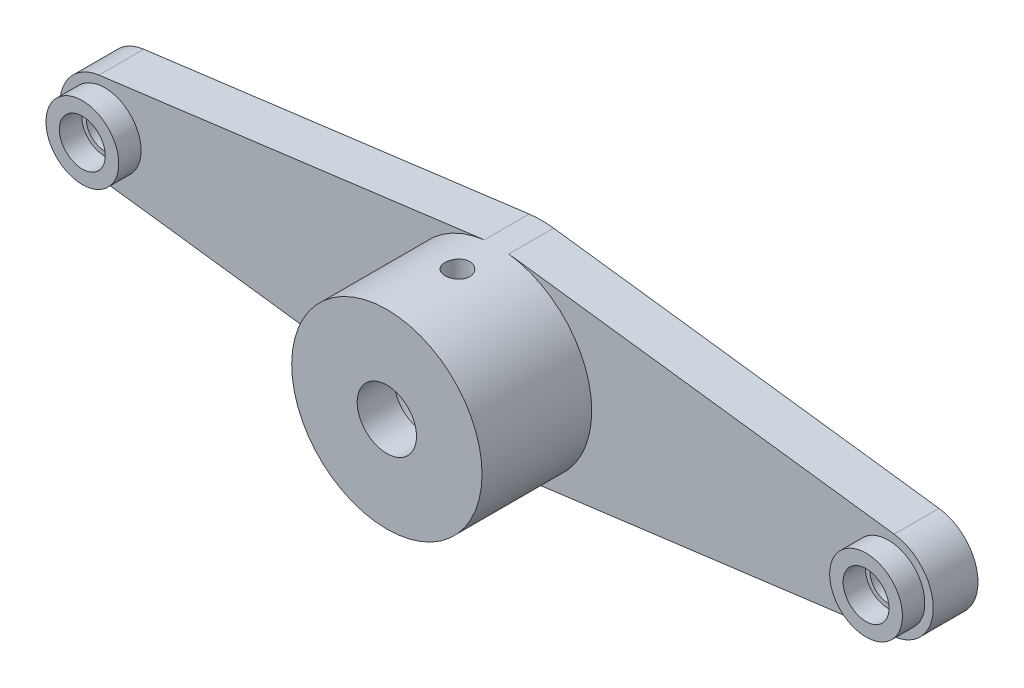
ISO-10303-21;
HEADER;
FILE_DESCRIPTION(('STEP AP214'),'2;1');
FILE_NAME('part.step','',(''),(''),'','','');
FILE_SCHEMA(('AUTOMOTIVE_DESIGN { 1 0 10303 214 1 1 1 1 }'));
ENDSEC;
DATA;
#1=APPLICATION_CONTEXT('core data for automotive mechanical design processes');
#2=APPLICATION_PROTOCOL_DEFINITION('international standard','automotive_design',2000,#1);
#3=PRODUCT_CONTEXT('',#1,'mechanical');
#4=PRODUCT('Part','Part','',(#3));
#5=PRODUCT_RELATED_PRODUCT_CATEGORY('part','',(#4));
#6=PRODUCT_DEFINITION_FORMATION('','',#4);
#7=PRODUCT_DEFINITION_CONTEXT('part definition',#1,'design');
#8=PRODUCT_DEFINITION('design','',#6,#7);
#9=PRODUCT_DEFINITION_SHAPE('','',#8);
#10=(LENGTH_UNIT() NAMED_UNIT(*) SI_UNIT(.MILLI.,.METRE.));
#11=(NAMED_UNIT(*) PLANE_ANGLE_UNIT() SI_UNIT($,.RADIAN.));
#12=(NAMED_UNIT(*) SI_UNIT($,.STERADIAN.) SOLID_ANGLE_UNIT());
#13=UNCERTAINTY_MEASURE_WITH_UNIT(LENGTH_MEASURE(1.E-05),#10,'distance_accuracy_value','');
#14=(GEOMETRIC_REPRESENTATION_CONTEXT(3) GLOBAL_UNCERTAINTY_ASSIGNED_CONTEXT((#13)) GLOBAL_UNIT_ASSIGNED_CONTEXT((#10,
#11,#12)) REPRESENTATION_CONTEXT('',''));
#15=CARTESIAN_POINT('',(0.,0.,0.));
#16=DIRECTION('',(0.,0.,1.));
#17=DIRECTION('',(1.,0.,0.));
#18=AXIS2_PLACEMENT_3D('',#15,#16,#17);
#19=CARTESIAN_POINT('',(-35.,0.,4.));
#20=DIRECTION('',(0.,0.,1.));
#21=DIRECTION('',(1.,0.,0.));
#22=AXIS2_PLACEMENT_3D('',#19,#20,#21);
#23=PLANE('',#22);
#24=CARTESIAN_POINT('',(35.,0.,4.));
#25=DIRECTION('',(0.,0.,1.));
#26=DIRECTION('',(1.,0.,0.));
#27=AXIS2_PLACEMENT_3D('',#24,#25,#26);
#28=CIRCLE('',#27,1.64999999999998);
#29=CARTESIAN_POINT('',(36.65,0.,4.));
#30=VERTEX_POINT('',#29);
#31=EDGE_CURVE('E249',#30,#30,#28,.T.);
#32=ORIENTED_EDGE('',*,*,#31,.F.);
#33=EDGE_LOOP('',(#32));
#34=FACE_BOUND('',#33,.T.);
#35=CARTESIAN_POINT('',(35.,0.,4.));
#36=DIRECTION('',(0.,0.,1.));
#37=DIRECTION('',(1.,0.,0.));
#38=AXIS2_PLACEMENT_3D('',#35,#36,#37);
#39=CIRCLE('',#38,2.04999999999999);
#40=CARTESIAN_POINT('',(37.05,0.,4.));
#41=VERTEX_POINT('',#40);
#42=EDGE_CURVE('E11',#41,#41,#39,.F.);
#43=ORIENTED_EDGE('',*,*,#42,.F.);
#44=EDGE_LOOP('',(#43));
#45=FACE_BOUND('',#44,.T.);
#46=ADVANCED_FACE('F36',(#34,#45),#23,.T.);
#47=CARTESIAN_POINT('',(-35.,0.,4.));
#48=DIRECTION('',(0.,0.,1.));
#49=DIRECTION('',(1.,0.,0.));
#50=AXIS2_PLACEMENT_3D('',#47,#48,#49);
#51=CIRCLE('',#50,1.64999999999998);
#52=CARTESIAN_POINT('',(-33.35,0.,4.));
#53=VERTEX_POINT('',#52);
#54=EDGE_CURVE('E322',#53,#53,#51,.T.);
#55=ORIENTED_EDGE('',*,*,#54,.F.);
#56=EDGE_LOOP('',(#55));
#57=FACE_BOUND('',#56,.T.);
#58=CARTESIAN_POINT('',(-35.,0.,4.));
#59=DIRECTION('',(0.,0.,1.));
#60=DIRECTION('',(1.,0.,0.));
#61=AXIS2_PLACEMENT_3D('',#58,#59,#60);
#62=CIRCLE('',#61,2.04999999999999);
#63=CARTESIAN_POINT('',(-32.95,0.,4.));
#64=VERTEX_POINT('',#63);
#65=EDGE_CURVE('E45',#64,#64,#62,.F.);
#66=ORIENTED_EDGE('',*,*,#65,.F.);
#67=EDGE_LOOP('',(#66));
#68=FACE_BOUND('',#67,.T.);
#69=ADVANCED_FACE('F220',(#57,#68),#23,.T.);
#70=CARTESIAN_POINT('',(0.,0.,4.));
#71=DIRECTION('',(0.,0.,-1.));
#72=DIRECTION('',(-1.,0.,0.));
#73=AXIS2_PLACEMENT_3D('',#70,#71,#72);
#74=CYLINDRICAL_SURFACE('',#73,5.25);
#75=CARTESIAN_POINT('',(0.,-5.25,8.6));
#76=CARTESIAN_POINT('',(0.061071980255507,-5.24999886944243,8.5999978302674));
#77=CARTESIAN_POINT('',(0.122170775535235,-5.24892346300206,8.59489674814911));
#78=CARTESIAN_POINT('',(0.242637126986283,-5.2447372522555,8.57464587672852));
#79=CARTESIAN_POINT('',(0.30200334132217,-5.24162491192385,8.55948850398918));
#80=CARTESIAN_POINT('',(0.417245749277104,-5.23371187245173,8.51961725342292));
#81=CARTESIAN_POINT('',(0.473125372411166,-5.22891286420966,8.49491294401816));
#82=CARTESIAN_POINT('',(0.579943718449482,-5.21814631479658,8.43667849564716));
#83=CARTESIAN_POINT('',(0.630882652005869,-5.212178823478,8.4031487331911));
#84=CARTESIAN_POINT('',(0.727130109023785,-5.19963186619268,8.32768978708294));
#85=CARTESIAN_POINT('',(0.772355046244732,-5.19304533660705,8.28565515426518));
#86=CARTESIAN_POINT('',(0.855166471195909,-5.18005322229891,8.19460621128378));
#87=CARTESIAN_POINT('',(0.892752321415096,-5.17364765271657,8.14559131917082));
#88=CARTESIAN_POINT('',(0.959580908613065,-5.16167342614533,8.0413635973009));
#89=CARTESIAN_POINT('',(0.988735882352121,-5.15611383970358,7.98609336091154));
#90=CARTESIAN_POINT('',(1.03731251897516,-5.1465619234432,7.8713026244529));
#91=CARTESIAN_POINT('',(1.0567352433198,-5.14256942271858,7.81178258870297));
#92=CARTESIAN_POINT('',(1.0850222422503,-5.13667543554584,7.69108486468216));
#93=CARTESIAN_POINT('',(1.0940338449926,-5.13474480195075,7.62994315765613));
#94=CARTESIAN_POINT('',(1.10170065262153,-5.13310551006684,7.50698754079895));
#95=CARTESIAN_POINT('',(1.10035702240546,-5.13339660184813,7.44517370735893));
#96=CARTESIAN_POINT('',(1.08747034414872,-5.136141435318,7.32371499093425));
#97=CARTESIAN_POINT('',(1.07609730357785,-5.13855912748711,7.26405113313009));
#98=CARTESIAN_POINT('',(1.04374348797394,-5.14522787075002,7.14749749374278));
#99=CARTESIAN_POINT('',(1.02276221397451,-5.14947901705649,7.09060785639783));
#100=CARTESIAN_POINT('',(0.971628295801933,-5.15937186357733,6.98073359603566));
#101=CARTESIAN_POINT('',(0.941409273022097,-5.16502357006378,6.92778080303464));
#102=CARTESIAN_POINT('',(0.872704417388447,-5.1770744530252,6.82763431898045));
#103=CARTESIAN_POINT('',(0.834217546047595,-5.18347372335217,6.78044135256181));
#104=CARTESIAN_POINT('',(0.749164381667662,-5.19645412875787,6.69217425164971));
#105=CARTESIAN_POINT('',(0.702453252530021,-5.20303635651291,6.65123971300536));
#106=CARTESIAN_POINT('',(0.602756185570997,-5.2155253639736,6.57776386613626));
#107=CARTESIAN_POINT('',(0.549770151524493,-5.22143213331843,6.54522268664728));
#108=CARTESIAN_POINT('',(0.438864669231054,-5.23192145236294,6.4894271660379));
#109=CARTESIAN_POINT('',(0.380936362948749,-5.23650155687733,6.46618994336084));
#110=CARTESIAN_POINT('',(0.261880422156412,-5.24380314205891,6.4298170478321));
#111=CARTESIAN_POINT('',(0.200753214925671,-5.24652487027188,6.4166800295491));
#112=CARTESIAN_POINT('',(0.0782331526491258,-5.24976818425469,6.40108077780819));
#113=CARTESIAN_POINT('',(0.0168656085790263,-5.25032910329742,6.39842768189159));
#114=CARTESIAN_POINT('',(-0.105435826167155,-5.24929733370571,6.40335592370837));
#115=CARTESIAN_POINT('',(-0.166369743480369,-5.24770477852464,6.4109366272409));
#116=CARTESIAN_POINT('',(-0.285450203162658,-5.2425697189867,6.43595884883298));
#117=CARTESIAN_POINT('',(-0.343618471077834,-5.23904680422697,6.45330135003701));
#118=CARTESIAN_POINT('',(-0.456220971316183,-5.23044491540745,6.4972458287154));
#119=CARTESIAN_POINT('',(-0.510654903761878,-5.22536581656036,6.5238485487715));
#120=CARTESIAN_POINT('',(-0.615040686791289,-5.21411740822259,6.58596360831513));
#121=CARTESIAN_POINT('',(-0.664923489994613,-5.20793452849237,6.62158947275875));
#122=CARTESIAN_POINT('',(-0.758071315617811,-5.19519412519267,6.70058878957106));
#123=CARTESIAN_POINT('',(-0.801335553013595,-5.18863655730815,6.74396315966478));
#124=CARTESIAN_POINT('',(-0.880763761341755,-5.17575162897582,6.83810068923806));
#125=CARTESIAN_POINT('',(-0.916796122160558,-5.16942999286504,6.88897581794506));
#126=CARTESIAN_POINT('',(-0.979805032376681,-5.1578592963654,6.99616811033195));
#127=CARTESIAN_POINT('',(-1.00678196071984,-5.15261019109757,7.05248504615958));
#128=CARTESIAN_POINT('',(-1.05074022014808,-5.14382620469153,7.16866798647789));
#129=CARTESIAN_POINT('',(-1.06777578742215,-5.14028204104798,7.22851273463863));
#130=CARTESIAN_POINT('',(-1.0915296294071,-5.13529094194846,7.35029833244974));
#131=CARTESIAN_POINT('',(-1.09824939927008,-5.13384370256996,7.41223887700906));
#132=CARTESIAN_POINT('',(-1.10112138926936,-5.13322833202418,7.53513371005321));
#133=CARTESIAN_POINT('',(-1.0974819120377,-5.13401527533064,7.59608299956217));
#134=CARTESIAN_POINT('',(-1.08020141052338,-5.13767861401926,7.71647954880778));
#135=CARTESIAN_POINT('',(-1.06656048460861,-5.1405549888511,7.77592682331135));
#136=CARTESIAN_POINT('',(-1.02976112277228,-5.14805209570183,7.89148290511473));
#137=CARTESIAN_POINT('',(-1.00663061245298,-5.15266770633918,7.94760095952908));
#138=CARTESIAN_POINT('',(-0.951533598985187,-5.16312566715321,8.05519160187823));
#139=CARTESIAN_POINT('',(-0.919566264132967,-5.1689681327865,8.10666375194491));
#140=CARTESIAN_POINT('',(-0.847001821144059,-5.18135734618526,8.20453358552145));
#141=CARTESIAN_POINT('',(-0.806255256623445,-5.18791517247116,8.25081907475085));
#142=CARTESIAN_POINT('',(-0.71759479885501,-5.20091926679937,8.3359641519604));
#143=CARTESIAN_POINT('',(-0.669679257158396,-5.20736550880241,8.37482202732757));
#144=CARTESIAN_POINT('',(-0.567366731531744,-5.21950926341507,8.44444094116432));
#145=CARTESIAN_POINT('',(-0.512900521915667,-5.22519714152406,8.47510200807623));
#146=CARTESIAN_POINT('',(-0.399482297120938,-5.23508763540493,8.52678650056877));
#147=CARTESIAN_POINT('',(-0.340534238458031,-5.23929154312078,8.54781831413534));
#148=CARTESIAN_POINT('',(-0.234574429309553,-5.24495671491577,8.57573493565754));
#149=CARTESIAN_POINT('',(-0.188151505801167,-5.24683655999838,8.58481755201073));
#150=CARTESIAN_POINT('',(-0.0944910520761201,-5.24935861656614,8.59695080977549));
#151=CARTESIAN_POINT('',(-0.0472535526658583,-5.2500008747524,8.60000167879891));
#152=CARTESIAN_POINT('',(0.,-5.25,8.6));
#153=B_SPLINE_CURVE_WITH_KNOTS('',3,(#75,#76,#77,#78,#79,#80,#81,#82,#83,#84,#85,#86,#87,#88,
#89,#90,#91,#92,#93,#94,#95,#96,#97,#98,#99,#100,#101,#102,#103,#104,#105,#106,#107,#108,#109,
#110,#111,#112,#113,#114,#115,#116,#117,#118,#119,#120,#121,#122,#123,#124,#125,#126,#127,#128,
#129,#130,#131,#132,#133,#134,#135,#136,#137,#138,#139,#140,#141,#142,#143,#144,#145,#146,#147,
#148,#149,#150,#151,#152),.UNSPECIFIED.,.T.,.F.,(4,2,2,2,2,2,2,2,2,2,2,2,2,2,2,2,2,2,2,2,2,2,2,
2,2,2,2,2,2,2,2,2,2,2,2,2,2,2,4),(0.,0.183043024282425,0.366224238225,0.549222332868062,
0.732212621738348,0.917628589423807,1.10306002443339,1.29035746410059,1.47763447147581,
1.6622275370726,1.84679983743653,2.02830234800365,2.20981428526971,2.39266243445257,
2.57553356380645,2.76202420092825,2.94851769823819,3.13535276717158,3.32216294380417,
3.50555608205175,3.68893785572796,3.87049221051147,4.05206112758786,4.23603899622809,
4.42003866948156,4.60713200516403,4.79421751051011,4.98027257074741,5.16630066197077,
5.34861470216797,5.5309269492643,5.71270649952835,5.89450316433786,6.07968129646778,
6.26490207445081,6.45228827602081,6.63951093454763,6.78114314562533,6.92277001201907),.UNSPECIFIED.);
#154=CARTESIAN_POINT('',(0.,-5.25,8.6));
#155=VERTEX_POINT('',#154);
#156=EDGE_CURVE('E208',#155,#155,#153,.T.);
#157=ORIENTED_EDGE('',*,*,#156,.F.);
#158=EDGE_LOOP('',(#157));
#159=FACE_BOUND('',#158,.T.);
#160=CARTESIAN_POINT('',(0.,5.25,8.6));
#161=CARTESIAN_POINT('',(-0.061071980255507,5.24999886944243,8.5999978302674));
#162=CARTESIAN_POINT('',(-0.122170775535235,5.24892346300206,8.59489674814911));
#163=CARTESIAN_POINT('',(-0.242637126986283,5.2447372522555,8.57464587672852));
#164=CARTESIAN_POINT('',(-0.30200334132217,5.24162491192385,8.55948850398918));
#165=CARTESIAN_POINT('',(-0.417245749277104,5.23371187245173,8.51961725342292));
#166=CARTESIAN_POINT('',(-0.473125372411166,5.22891286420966,8.49491294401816));
#167=CARTESIAN_POINT('',(-0.579943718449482,5.21814631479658,8.43667849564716));
#168=CARTESIAN_POINT('',(-0.630882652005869,5.212178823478,8.4031487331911));
#169=CARTESIAN_POINT('',(-0.727130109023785,5.19963186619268,8.32768978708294));
#170=CARTESIAN_POINT('',(-0.772355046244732,5.19304533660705,8.28565515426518));
#171=CARTESIAN_POINT('',(-0.855166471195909,5.18005322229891,8.19460621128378));
#172=CARTESIAN_POINT('',(-0.892752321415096,5.17364765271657,8.14559131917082));
#173=CARTESIAN_POINT('',(-0.959580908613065,5.16167342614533,8.0413635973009));
#174=CARTESIAN_POINT('',(-0.988735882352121,5.15611383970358,7.98609336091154));
#175=CARTESIAN_POINT('',(-1.03731251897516,5.1465619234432,7.8713026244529));
#176=CARTESIAN_POINT('',(-1.0567352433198,5.14256942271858,7.81178258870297));
#177=CARTESIAN_POINT('',(-1.0850222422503,5.13667543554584,7.69108486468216));
#178=CARTESIAN_POINT('',(-1.0940338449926,5.13474480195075,7.62994315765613));
#179=CARTESIAN_POINT('',(-1.10170065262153,5.13310551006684,7.50698754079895));
#180=CARTESIAN_POINT('',(-1.10035702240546,5.13339660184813,7.44517370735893));
#181=CARTESIAN_POINT('',(-1.08747034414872,5.136141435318,7.32371499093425));
#182=CARTESIAN_POINT('',(-1.07609730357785,5.13855912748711,7.26405113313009));
#183=CARTESIAN_POINT('',(-1.04374348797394,5.14522787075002,7.14749749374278));
#184=CARTESIAN_POINT('',(-1.02276221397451,5.14947901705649,7.09060785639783));
#185=CARTESIAN_POINT('',(-0.971628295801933,5.15937186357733,6.98073359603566));
#186=CARTESIAN_POINT('',(-0.941409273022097,5.16502357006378,6.92778080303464));
#187=CARTESIAN_POINT('',(-0.872704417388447,5.1770744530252,6.82763431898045));
#188=CARTESIAN_POINT('',(-0.834217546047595,5.18347372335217,6.78044135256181));
#189=CARTESIAN_POINT('',(-0.749164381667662,5.19645412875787,6.69217425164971));
#190=CARTESIAN_POINT('',(-0.702453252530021,5.20303635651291,6.65123971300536));
#191=CARTESIAN_POINT('',(-0.602756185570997,5.2155253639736,6.57776386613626));
#192=CARTESIAN_POINT('',(-0.549770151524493,5.22143213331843,6.54522268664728));
#193=CARTESIAN_POINT('',(-0.438864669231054,5.23192145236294,6.4894271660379));
#194=CARTESIAN_POINT('',(-0.380936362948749,5.23650155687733,6.46618994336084));
#195=CARTESIAN_POINT('',(-0.261880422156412,5.24380314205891,6.4298170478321));
#196=CARTESIAN_POINT('',(-0.200753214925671,5.24652487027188,6.4166800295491));
#197=CARTESIAN_POINT('',(-0.0782331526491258,5.24976818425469,6.40108077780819));
#198=CARTESIAN_POINT('',(-0.0168656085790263,5.25032910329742,6.39842768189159));
#199=CARTESIAN_POINT('',(0.105435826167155,5.24929733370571,6.40335592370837));
#200=CARTESIAN_POINT('',(0.166369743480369,5.24770477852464,6.4109366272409));
#201=CARTESIAN_POINT('',(0.285450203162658,5.2425697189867,6.43595884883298));
#202=CARTESIAN_POINT('',(0.343618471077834,5.23904680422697,6.45330135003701));
#203=CARTESIAN_POINT('',(0.456220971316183,5.23044491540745,6.4972458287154));
#204=CARTESIAN_POINT('',(0.510654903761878,5.22536581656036,6.5238485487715));
#205=CARTESIAN_POINT('',(0.615040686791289,5.21411740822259,6.58596360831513));
#206=CARTESIAN_POINT('',(0.664923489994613,5.20793452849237,6.62158947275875));
#207=CARTESIAN_POINT('',(0.758071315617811,5.19519412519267,6.70058878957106));
#208=CARTESIAN_POINT('',(0.801335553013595,5.18863655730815,6.74396315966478));
#209=CARTESIAN_POINT('',(0.880763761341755,5.17575162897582,6.83810068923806));
#210=CARTESIAN_POINT('',(0.916796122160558,5.16942999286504,6.88897581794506));
#211=CARTESIAN_POINT('',(0.979805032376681,5.1578592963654,6.99616811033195));
#212=CARTESIAN_POINT('',(1.00678196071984,5.15261019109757,7.05248504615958));
#213=CARTESIAN_POINT('',(1.05074022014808,5.14382620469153,7.16866798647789));
#214=CARTESIAN_POINT('',(1.06777578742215,5.14028204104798,7.22851273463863));
#215=CARTESIAN_POINT('',(1.0915296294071,5.13529094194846,7.35029833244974));
#216=CARTESIAN_POINT('',(1.09824939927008,5.13384370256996,7.41223887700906));
#217=CARTESIAN_POINT('',(1.10112138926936,5.13322833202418,7.53513371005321));
#218=CARTESIAN_POINT('',(1.0974819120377,5.13401527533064,7.59608299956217));
#219=CARTESIAN_POINT('',(1.08020141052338,5.13767861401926,7.71647954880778));
#220=CARTESIAN_POINT('',(1.06656048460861,5.1405549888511,7.77592682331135));
#221=CARTESIAN_POINT('',(1.02976112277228,5.14805209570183,7.89148290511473));
#222=CARTESIAN_POINT('',(1.00663061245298,5.15266770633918,7.94760095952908));
#223=CARTESIAN_POINT('',(0.951533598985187,5.16312566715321,8.05519160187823));
#224=CARTESIAN_POINT('',(0.919566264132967,5.1689681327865,8.10666375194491));
#225=CARTESIAN_POINT('',(0.847001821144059,5.18135734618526,8.20453358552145));
#226=CARTESIAN_POINT('',(0.806255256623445,5.18791517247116,8.25081907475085));
#227=CARTESIAN_POINT('',(0.71759479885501,5.20091926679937,8.3359641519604));
#228=CARTESIAN_POINT('',(0.669679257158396,5.20736550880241,8.37482202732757));
#229=CARTESIAN_POINT('',(0.567366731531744,5.21950926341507,8.44444094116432));
#230=CARTESIAN_POINT('',(0.512900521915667,5.22519714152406,8.47510200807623));
#231=CARTESIAN_POINT('',(0.399482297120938,5.23508763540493,8.52678650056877));
#232=CARTESIAN_POINT('',(0.340534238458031,5.23929154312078,8.54781831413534));
#233=CARTESIAN_POINT('',(0.234574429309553,5.24495671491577,8.57573493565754));
#234=CARTESIAN_POINT('',(0.188151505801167,5.24683655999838,8.58481755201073));
#235=CARTESIAN_POINT('',(0.0944910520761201,5.24935861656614,8.59695080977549));
#236=CARTESIAN_POINT('',(0.0472535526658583,5.2500008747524,8.60000167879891));
#237=CARTESIAN_POINT('',(0.,5.25,8.6));
#238=B_SPLINE_CURVE_WITH_KNOTS('',3,(#160,#161,#162,#163,#164,#165,#166,#167,#168,#169,#170,
#171,#172,#173,#174,#175,#176,#177,#178,#179,#180,#181,#182,#183,#184,#185,#186,#187,#188,#189,
#190,#191,#192,#193,#194,#195,#196,#197,#198,#199,#200,#201,#202,#203,#204,#205,#206,#207,#208,
#209,#210,#211,#212,#213,#214,#215,#216,#217,#218,#219,#220,#221,#222,#223,#224,#225,#226,#227,
#228,#229,#230,#231,#232,#233,#234,#235,#236,#237),.UNSPECIFIED.,.T.,.F.,(4,2,2,2,2,2,2,2,2,2,2,
2,2,2,2,2,2,2,2,2,2,2,2,2,2,2,2,2,2,2,2,2,2,2,2,2,2,2,4),(0.,0.183043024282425,0.366224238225,
0.549222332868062,0.732212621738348,0.917628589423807,1.10306002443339,1.29035746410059,
1.47763447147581,1.6622275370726,1.84679983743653,2.02830234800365,2.20981428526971,
2.39266243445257,2.57553356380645,2.76202420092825,2.94851769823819,3.13535276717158,
3.32216294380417,3.50555608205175,3.68893785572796,3.87049221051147,4.05206112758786,
4.23603899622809,4.42003866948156,4.60713200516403,4.79421751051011,4.98027257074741,
5.16630066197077,5.34861470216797,5.5309269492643,5.71270649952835,5.89450316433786,
6.07968129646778,6.26490207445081,6.45228827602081,6.63951093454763,6.78114314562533,
6.92277001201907),.UNSPECIFIED.);
#239=CARTESIAN_POINT('',(0.,5.25,8.6));
#240=VERTEX_POINT('',#239);
#241=EDGE_CURVE('E202',#240,#240,#238,.T.);
#242=ORIENTED_EDGE('',*,*,#241,.F.);
#243=EDGE_LOOP('',(#242));
#244=FACE_BOUND('',#243,.T.);
#245=CARTESIAN_POINT('',(0.,0.,0.));
#246=DIRECTION('',(0.,0.,1.));
#247=DIRECTION('',(1.,0.,0.));
#248=AXIS2_PLACEMENT_3D('',#245,#246,#247);
#249=CIRCLE('',#248,5.25);
#250=CARTESIAN_POINT('',(5.25,0.,0.));
#251=VERTEX_POINT('',#250);
#252=EDGE_CURVE('E144',#251,#251,#249,.T.);
#253=ORIENTED_EDGE('',*,*,#252,.F.);
#254=EDGE_LOOP('',(#253));
#255=FACE_BOUND('',#254,.T.);
#256=CARTESIAN_POINT('',(0.,0.,10.5));
#257=DIRECTION('',(0.,0.,1.));
#258=DIRECTION('',(1.,0.,0.));
#259=AXIS2_PLACEMENT_3D('',#256,#257,#258);
#260=CIRCLE('',#259,5.25);
#261=CARTESIAN_POINT('',(5.25,0.,10.5));
#262=VERTEX_POINT('',#261);
#263=EDGE_CURVE('E328',#262,#262,#260,.T.);
#264=ORIENTED_EDGE('',*,*,#263,.T.);
#265=EDGE_LOOP('',(#264));
#266=FACE_BOUND('',#265,.T.);
#267=ADVANCED_FACE('F214',(#159,#244,#255,#266),#74,.F.);
#268=CARTESIAN_POINT('',(-35.,0.,4.));
#269=DIRECTION('',(0.,0.,1.));
#270=DIRECTION('',(1.,0.,0.));
#271=AXIS2_PLACEMENT_3D('',#268,#269,#270);
#272=CIRCLE('',#271,3.25);
#273=CARTESIAN_POINT('',(-31.75,0.,4.));
#274=VERTEX_POINT('',#273);
#275=EDGE_CURVE('E209',#274,#274,#272,.T.);
#276=ORIENTED_EDGE('',*,*,#275,.F.);
#277=EDGE_LOOP('',(#276));
#278=FACE_BOUND('',#277,.T.);
#279=CARTESIAN_POINT('',(0.,0.,4.));
#280=DIRECTION('',(0.,0.,1.));
#281=DIRECTION('',(1.,0.,0.));
#282=AXIS2_PLACEMENT_3D('',#279,#280,#281);
#283=CIRCLE('',#282,8.5);
#284=CARTESIAN_POINT('',(-1.09285714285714,8.42945213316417,4.));
#285=VERTEX_POINT('',#284);
#286=CARTESIAN_POINT('',(-1.09285714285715,-8.42945213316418,4.));
#287=VERTEX_POINT('',#286);
#288=EDGE_CURVE('E303',#285,#287,#283,.T.);
#289=ORIENTED_EDGE('',*,*,#288,.F.);
#290=DIRECTION('',(-0.991700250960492,-0.128571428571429,0.));
#291=VECTOR('',#290,1.);
#292=CARTESIAN_POINT('',(-35.5142857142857,3.96680100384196,4.));
#293=LINE('',#292,#291);
#294=CARTESIAN_POINT('',(-35.5142857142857,3.96680100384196,4.));
#295=VERTEX_POINT('',#294);
#296=EDGE_CURVE('E53',#285,#295,#293,.T.);
#297=ORIENTED_EDGE('',*,*,#296,.T.);
#298=CARTESIAN_POINT('',(-35.,0.,4.));
#299=DIRECTION('',(0.,0.,1.));
#300=DIRECTION('',(1.,0.,0.));
#301=AXIS2_PLACEMENT_3D('',#298,#299,#300);
#302=CIRCLE('',#301,4.);
#303=CARTESIAN_POINT('',(-35.5142857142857,-3.96680100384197,4.));
#304=VERTEX_POINT('',#303);
#305=EDGE_CURVE('E155',#295,#304,#302,.T.);
#306=ORIENTED_EDGE('',*,*,#305,.T.);
#307=DIRECTION('',(0.991700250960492,-0.128571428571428,0.));
#308=VECTOR('',#307,1.);
#309=CARTESIAN_POINT('',(-35.5142857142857,-3.96680100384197,4.));
#310=LINE('',#309,#308);
#311=EDGE_CURVE('E98',#304,#287,#310,.T.);
#312=ORIENTED_EDGE('',*,*,#311,.T.);
#313=EDGE_LOOP('',(#289,#297,#306,#312));
#314=FACE_BOUND('',#313,.T.);
#315=ADVANCED_FACE('F219',(#278,#314),#23,.T.);
#316=CARTESIAN_POINT('',(35.,0.,4.));
#317=DIRECTION('',(0.,0.,1.));
#318=DIRECTION('',(-1.,0.,0.));
#319=AXIS2_PLACEMENT_3D('',#316,#317,#318);
#320=CIRCLE('',#319,3.25);
#321=CARTESIAN_POINT('',(31.75,0.,4.));
#322=VERTEX_POINT('',#321);
#323=EDGE_CURVE('E287',#322,#322,#320,.T.);
#324=ORIENTED_EDGE('',*,*,#323,.F.);
#325=EDGE_LOOP('',(#324));
#326=FACE_BOUND('',#325,.T.);
#327=CARTESIAN_POINT('',(1.09285714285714,-8.42945213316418,4.));
#328=VERTEX_POINT('',#327);
#329=CARTESIAN_POINT('',(1.09285714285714,8.42945213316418,4.));
#330=VERTEX_POINT('',#329);
#331=EDGE_CURVE('E169',#328,#330,#283,.T.);
#332=ORIENTED_EDGE('',*,*,#331,.F.);
#333=DIRECTION('',(0.991700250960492,0.128571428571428,0.));
#334=VECTOR('',#333,1.);
#335=CARTESIAN_POINT('',(35.5142857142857,-3.96680100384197,4.));
#336=LINE('',#335,#334);
#337=CARTESIAN_POINT('',(35.5142857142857,-3.96680100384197,4.));
#338=VERTEX_POINT('',#337);
#339=EDGE_CURVE('E118',#328,#338,#336,.T.);
#340=ORIENTED_EDGE('',*,*,#339,.T.);
#341=CARTESIAN_POINT('',(35.,0.,4.));
#342=DIRECTION('',(0.,0.,1.));
#343=DIRECTION('',(-1.,0.,0.));
#344=AXIS2_PLACEMENT_3D('',#341,#342,#343);
#345=CIRCLE('',#344,4.);
#346=CARTESIAN_POINT('',(35.5142857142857,3.96680100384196,4.));
#347=VERTEX_POINT('',#346);
#348=EDGE_CURVE('E111',#338,#347,#345,.T.);
#349=ORIENTED_EDGE('',*,*,#348,.T.);
#350=DIRECTION('',(-0.991700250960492,0.128571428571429,0.));
#351=VECTOR('',#350,1.);
#352=CARTESIAN_POINT('',(35.5142857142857,3.96680100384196,4.));
#353=LINE('',#352,#351);
#354=EDGE_CURVE('E115',#347,#330,#353,.T.);
#355=ORIENTED_EDGE('',*,*,#354,.T.);
#356=EDGE_LOOP('',(#332,#340,#349,#355));
#357=FACE_BOUND('',#356,.T.);
#358=ADVANCED_FACE('F113',(#326,#357),#23,.T.);
#359=CARTESIAN_POINT('',(-35.,0.,0.));
#360=DIRECTION('',(0.,0.,1.));
#361=DIRECTION('',(1.,0.,0.));
#362=AXIS2_PLACEMENT_3D('',#359,#360,#361);
#363=PLANE('',#362);
#364=CARTESIAN_POINT('',(-35.,0.,0.));
#365=DIRECTION('',(0.,0.,1.));
#366=DIRECTION('',(1.,0.,0.));
#367=AXIS2_PLACEMENT_3D('',#364,#365,#366);
#368=CIRCLE('',#367,1.65);
#369=CARTESIAN_POINT('',(-33.35,0.,0.));
#370=VERTEX_POINT('',#369);
#371=EDGE_CURVE('E319',#370,#370,#368,.T.);
#372=ORIENTED_EDGE('',*,*,#371,.T.);
#373=EDGE_LOOP('',(#372));
#374=FACE_BOUND('',#373,.T.);
#375=CARTESIAN_POINT('',(35.,0.,0.));
#376=DIRECTION('',(0.,0.,1.));
#377=DIRECTION('',(1.,0.,0.));
#378=AXIS2_PLACEMENT_3D('',#375,#376,#377);
#379=CIRCLE('',#378,1.65);
#380=CARTESIAN_POINT('',(36.65,0.,0.));
#381=VERTEX_POINT('',#380);
#382=EDGE_CURVE('E315',#381,#381,#379,.T.);
#383=ORIENTED_EDGE('',*,*,#382,.T.);
#384=EDGE_LOOP('',(#383));
#385=FACE_BOUND('',#384,.T.);
#386=CARTESIAN_POINT('',(-35.,0.,0.));
#387=DIRECTION('',(0.,0.,1.));
#388=DIRECTION('',(1.,0.,0.));
#389=AXIS2_PLACEMENT_3D('',#386,#387,#388);
#390=CIRCLE('',#389,4.);
#391=CARTESIAN_POINT('',(-35.5142857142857,3.96680100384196,0.));
#392=VERTEX_POINT('',#391);
#393=CARTESIAN_POINT('',(-35.5142857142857,-3.96680100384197,0.));
#394=VERTEX_POINT('',#393);
#395=EDGE_CURVE('E140',#392,#394,#390,.T.);
#396=ORIENTED_EDGE('',*,*,#395,.F.);
#397=DIRECTION('',(-0.991700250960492,-0.128571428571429,0.));
#398=VECTOR('',#397,1.);
#399=CARTESIAN_POINT('',(-35.5142857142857,3.96680100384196,0.));
#400=LINE('',#399,#398);
#401=CARTESIAN_POINT('',(-1.09285714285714,8.42945213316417,0.));
#402=VERTEX_POINT('',#401);
#403=EDGE_CURVE('E89',#402,#392,#400,.T.);
#404=ORIENTED_EDGE('',*,*,#403,.F.);
#405=CARTESIAN_POINT('',(0.,0.,0.));
#406=DIRECTION('',(0.,0.,1.));
#407=DIRECTION('',(1.,0.,0.));
#408=AXIS2_PLACEMENT_3D('',#405,#406,#407);
#409=CIRCLE('',#408,8.5);
#410=CARTESIAN_POINT('',(1.09285714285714,8.42945213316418,0.));
#411=VERTEX_POINT('',#410);
#412=EDGE_CURVE('E83',#411,#402,#409,.T.);
#413=ORIENTED_EDGE('',*,*,#412,.F.);
#414=DIRECTION('',(-0.991700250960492,0.128571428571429,0.));
#415=VECTOR('',#414,1.);
#416=CARTESIAN_POINT('',(35.5142857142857,3.96680100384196,0.));
#417=LINE('',#416,#415);
#418=CARTESIAN_POINT('',(35.5142857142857,3.96680100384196,0.));
#419=VERTEX_POINT('',#418);
#420=EDGE_CURVE('E151',#419,#411,#417,.T.);
#421=ORIENTED_EDGE('',*,*,#420,.F.);
#422=CARTESIAN_POINT('',(35.,0.,0.));
#423=DIRECTION('',(0.,0.,1.));
#424=DIRECTION('',(-1.,0.,0.));
#425=AXIS2_PLACEMENT_3D('',#422,#423,#424);
#426=CIRCLE('',#425,4.);
#427=CARTESIAN_POINT('',(35.5142857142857,-3.96680100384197,0.));
#428=VERTEX_POINT('',#427);
#429=EDGE_CURVE('E127',#428,#419,#426,.T.);
#430=ORIENTED_EDGE('',*,*,#429,.F.);
#431=DIRECTION('',(0.991700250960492,0.128571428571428,0.));
#432=VECTOR('',#431,1.);
#433=CARTESIAN_POINT('',(35.5142857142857,-3.96680100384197,0.));
#434=LINE('',#433,#432);
#435=CARTESIAN_POINT('',(1.09285714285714,-8.42945213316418,0.));
#436=VERTEX_POINT('',#435);
#437=EDGE_CURVE('E148',#436,#428,#434,.T.);
#438=ORIENTED_EDGE('',*,*,#437,.F.);
#439=CARTESIAN_POINT('',(0.,0.,0.));
#440=DIRECTION('',(0.,0.,1.));
#441=DIRECTION('',(1.,0.,0.));
#442=AXIS2_PLACEMENT_3D('',#439,#440,#441);
#443=CIRCLE('',#442,8.5);
#444=CARTESIAN_POINT('',(-1.09285714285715,-8.42945213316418,0.));
#445=VERTEX_POINT('',#444);
#446=EDGE_CURVE('E146',#445,#436,#443,.T.);
#447=ORIENTED_EDGE('',*,*,#446,.F.);
#448=DIRECTION('',(0.991700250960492,-0.128571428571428,0.));
#449=VECTOR('',#448,1.);
#450=CARTESIAN_POINT('',(-35.5142857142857,-3.96680100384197,0.));
#451=LINE('',#450,#449);
#452=EDGE_CURVE('E143',#394,#445,#451,.T.);
#453=ORIENTED_EDGE('',*,*,#452,.F.);
#454=EDGE_LOOP('',(#396,#404,#413,#421,#430,#438,#447,#453));
#455=FACE_BOUND('',#454,.T.);
#456=ORIENTED_EDGE('',*,*,#252,.T.);
#457=EDGE_LOOP('',(#456));
#458=FACE_BOUND('',#457,.T.);
#459=ADVANCED_FACE('F227',(#374,#385,#455,#458),#363,.F.);
#460=CARTESIAN_POINT('',(-35.,0.,4.));
#461=DIRECTION('',(0.,0.,-1.));
#462=DIRECTION('',(-1.,0.,0.));
#463=AXIS2_PLACEMENT_3D('',#460,#461,#462);
#464=CYLINDRICAL_SURFACE('',#463,4.);
#465=ORIENTED_EDGE('',*,*,#395,.T.);
#466=DIRECTION('',(0.,0.,-1.));
#467=VECTOR('',#466,1.);
#468=CARTESIAN_POINT('',(-35.5142857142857,-3.96680100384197,4.));
#469=LINE('',#468,#467);
#470=EDGE_CURVE('E167',#304,#394,#469,.T.);
#471=ORIENTED_EDGE('',*,*,#470,.F.);
#472=ORIENTED_EDGE('',*,*,#305,.F.);
#473=DIRECTION('',(0.,0.,-1.));
#474=VECTOR('',#473,1.);
#475=CARTESIAN_POINT('',(-35.5142857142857,3.96680100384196,4.));
#476=LINE('',#475,#474);
#477=EDGE_CURVE('E136',#295,#392,#476,.T.);
#478=ORIENTED_EDGE('',*,*,#477,.T.);
#479=EDGE_LOOP('',(#465,#471,#472,#478));
#480=FACE_BOUND('',#479,.T.);
#481=ADVANCED_FACE('F38',(#480),#464,.T.);
#482=CARTESIAN_POINT('',(-35.5142857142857,-3.96680100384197,4.));
#483=DIRECTION('',(0.128571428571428,0.991700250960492,0.));
#484=DIRECTION('',(-0.991700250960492,0.128571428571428,0.));
#485=AXIS2_PLACEMENT_3D('',#482,#483,#484);
#486=PLANE('',#485);
#487=ORIENTED_EDGE('',*,*,#452,.T.);
#488=DIRECTION('',(0.,0.,-1.));
#489=VECTOR('',#488,1.);
#490=CARTESIAN_POINT('',(-1.09285714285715,-8.42945213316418,4.));
#491=LINE('',#490,#489);
#492=EDGE_CURVE('E164',#287,#445,#491,.T.);
#493=ORIENTED_EDGE('',*,*,#492,.F.);
#494=ORIENTED_EDGE('',*,*,#311,.F.);
#495=ORIENTED_EDGE('',*,*,#470,.T.);
#496=EDGE_LOOP('',(#487,#493,#494,#495));
#497=FACE_BOUND('',#496,.T.);
#498=ADVANCED_FACE('F373',(#497),#486,.F.);
#499=CARTESIAN_POINT('',(35.5142857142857,-3.96680100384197,4.));
#500=DIRECTION('',(-0.128571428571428,0.991700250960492,0.));
#501=DIRECTION('',(-0.991700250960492,-0.128571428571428,0.));
#502=AXIS2_PLACEMENT_3D('',#499,#500,#501);
#503=PLANE('',#502);
#504=ORIENTED_EDGE('',*,*,#437,.T.);
#505=DIRECTION('',(0.,0.,-1.));
#506=VECTOR('',#505,1.);
#507=CARTESIAN_POINT('',(35.5142857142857,-3.96680100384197,4.));
#508=LINE('',#507,#506);
#509=EDGE_CURVE('E130',#338,#428,#508,.T.);
#510=ORIENTED_EDGE('',*,*,#509,.F.);
#511=ORIENTED_EDGE('',*,*,#339,.F.);
#512=DIRECTION('',(0.,0.,-1.));
#513=VECTOR('',#512,1.);
#514=CARTESIAN_POINT('',(1.09285714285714,-8.42945213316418,4.));
#515=LINE('',#514,#513);
#516=EDGE_CURVE('E161',#328,#436,#515,.T.);
#517=ORIENTED_EDGE('',*,*,#516,.T.);
#518=EDGE_LOOP('',(#504,#510,#511,#517));
#519=FACE_BOUND('',#518,.T.);
#520=ADVANCED_FACE('F375',(#519),#503,.F.);
#521=CARTESIAN_POINT('',(35.,0.,4.));
#522=DIRECTION('',(0.,0.,-1.));
#523=DIRECTION('',(-1.,0.,0.));
#524=AXIS2_PLACEMENT_3D('',#521,#522,#523);
#525=CYLINDRICAL_SURFACE('',#524,4.);
#526=ORIENTED_EDGE('',*,*,#429,.T.);
#527=DIRECTION('',(0.,0.,-1.));
#528=VECTOR('',#527,1.);
#529=CARTESIAN_POINT('',(35.5142857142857,3.96680100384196,4.));
#530=LINE('',#529,#528);
#531=EDGE_CURVE('E124',#347,#419,#530,.T.);
#532=ORIENTED_EDGE('',*,*,#531,.F.);
#533=ORIENTED_EDGE('',*,*,#348,.F.);
#534=ORIENTED_EDGE('',*,*,#509,.T.);
#535=EDGE_LOOP('',(#526,#532,#533,#534));
#536=FACE_BOUND('',#535,.T.);
#537=ADVANCED_FACE('F125',(#536),#525,.T.);
#538=CARTESIAN_POINT('',(35.5142857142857,3.96680100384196,4.));
#539=DIRECTION('',(-0.128571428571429,-0.991700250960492,0.));
#540=DIRECTION('',(0.991700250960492,-0.128571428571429,0.));
#541=AXIS2_PLACEMENT_3D('',#538,#539,#540);
#542=PLANE('',#541);
#543=ORIENTED_EDGE('',*,*,#420,.T.);
#544=DIRECTION('',(0.,0.,-1.));
#545=VECTOR('',#544,1.);
#546=CARTESIAN_POINT('',(1.09285714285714,8.42945213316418,4.));
#547=LINE('',#546,#545);
#548=EDGE_CURVE('E131',#330,#411,#547,.T.);
#549=ORIENTED_EDGE('',*,*,#548,.F.);
#550=ORIENTED_EDGE('',*,*,#354,.F.);
#551=ORIENTED_EDGE('',*,*,#531,.T.);
#552=EDGE_LOOP('',(#543,#549,#550,#551));
#553=FACE_BOUND('',#552,.T.);
#554=ADVANCED_FACE('F134',(#553),#542,.F.);
#555=CARTESIAN_POINT('',(0.,0.,4.));
#556=DIRECTION('',(0.,0.,-1.));
#557=DIRECTION('',(-1.,0.,0.));
#558=AXIS2_PLACEMENT_3D('',#555,#556,#557);
#559=CYLINDRICAL_SURFACE('',#558,8.5);
#560=CARTESIAN_POINT('',(0.,-8.5,8.6));
#561=CARTESIAN_POINT('',(0.0615117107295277,-8.49999911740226,8.5999973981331));
#562=CARTESIAN_POINT('',(0.123061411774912,-8.49932524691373,8.5948230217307));
#563=CARTESIAN_POINT('',(0.244446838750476,-8.49670186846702,8.57426381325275));
#564=CARTESIAN_POINT('',(0.30428072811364,-8.49475104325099,8.55886843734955));
#565=CARTESIAN_POINT('',(0.42045975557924,-8.48979343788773,8.5183294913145));
#566=CARTESIAN_POINT('',(0.476807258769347,-8.48678738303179,8.49319261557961));
#567=CARTESIAN_POINT('',(0.584473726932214,-8.48005329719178,8.4338991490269));
#568=CARTESIAN_POINT('',(0.635793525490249,-8.4763253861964,8.39974405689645));
#569=CARTESIAN_POINT('',(0.732260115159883,-8.46853900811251,8.32316898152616));
#570=CARTESIAN_POINT('',(0.777373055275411,-8.46447890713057,8.2807065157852));
#571=CARTESIAN_POINT('',(0.859853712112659,-8.45649885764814,8.18881330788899));
#572=CARTESIAN_POINT('',(0.897221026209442,-8.45257891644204,8.13938220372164));
#573=CARTESIAN_POINT('',(0.963276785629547,-8.44530698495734,8.03473360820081));
#574=CARTESIAN_POINT('',(0.991933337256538,-8.44195710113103,7.97949582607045));
#575=CARTESIAN_POINT('',(1.03955041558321,-8.43622626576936,7.86494112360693));
#576=CARTESIAN_POINT('',(1.05851133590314,-8.43384527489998,7.80562436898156));
#577=CARTESIAN_POINT('',(1.08609566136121,-8.43033750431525,7.68494769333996));
#578=CARTESIAN_POINT('',(1.09477636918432,-8.42920377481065,7.62360107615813));
#579=CARTESIAN_POINT('',(1.10173120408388,-8.42829765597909,7.50031212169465));
#580=CARTESIAN_POINT('',(1.10000577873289,-8.42852520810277,7.43836981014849));
#581=CARTESIAN_POINT('',(1.08624432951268,-8.43030958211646,7.31604801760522));
#582=CARTESIAN_POINT('',(1.07427154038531,-8.43185825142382,7.25566128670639));
#583=CARTESIAN_POINT('',(1.04045394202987,-8.43609764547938,7.13776132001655));
#584=CARTESIAN_POINT('',(1.01860891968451,-8.4387883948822,7.08024814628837));
#585=CARTESIAN_POINT('',(0.96559934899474,-8.44501797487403,6.9695321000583));
#586=CARTESIAN_POINT('',(0.934407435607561,-8.44855928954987,6.91634247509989));
#587=CARTESIAN_POINT('',(0.863609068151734,-8.45608908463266,6.81592859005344));
#588=CARTESIAN_POINT('',(0.824002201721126,-8.46007758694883,6.76870462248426));
#589=CARTESIAN_POINT('',(0.737148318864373,-8.46808855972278,6.6811956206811));
#590=CARTESIAN_POINT('',(0.689846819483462,-8.47211106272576,6.64096464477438));
#591=CARTESIAN_POINT('',(0.589133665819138,-8.47970916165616,6.56900493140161));
#592=CARTESIAN_POINT('',(0.535721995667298,-8.48328475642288,6.53727621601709));
#593=CARTESIAN_POINT('',(0.424262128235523,-8.48958861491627,6.48322119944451));
#594=CARTESIAN_POINT('',(0.366212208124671,-8.49231656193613,6.46089841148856));
#595=CARTESIAN_POINT('',(0.247144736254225,-8.49661493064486,6.42633249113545));
#596=CARTESIAN_POINT('',(0.18612733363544,-8.49818541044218,6.41408885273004));
#597=CARTESIAN_POINT('',(0.0633242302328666,-8.49998431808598,6.40009914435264));
#598=CARTESIAN_POINT('',(0.00154714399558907,-8.50022226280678,6.3982786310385));
#599=CARTESIAN_POINT('',(-0.121431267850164,-8.49935502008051,6.4049902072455));
#600=CARTESIAN_POINT('',(-0.182632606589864,-8.4982498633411,6.41352206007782));
#601=CARTESIAN_POINT('',(-0.302501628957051,-8.4948265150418,6.4406343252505));
#602=CARTESIAN_POINT('',(-0.361177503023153,-8.49251262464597,6.45917911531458));
#603=CARTESIAN_POINT('',(-0.474586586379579,-8.48693078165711,6.5057537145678));
#604=CARTESIAN_POINT('',(-0.529319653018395,-8.48366279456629,6.53378386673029));
#605=CARTESIAN_POINT('',(-0.633621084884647,-8.47651317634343,6.59871273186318));
#606=CARTESIAN_POINT('',(-0.68315933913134,-8.4726282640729,6.63565944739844));
#607=CARTESIAN_POINT('',(-0.775358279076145,-8.46468930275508,6.71730492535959));
#608=CARTESIAN_POINT('',(-0.818018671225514,-8.46063524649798,6.76200401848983));
#609=CARTESIAN_POINT('',(-0.895516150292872,-8.45278541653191,6.85821391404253));
#610=CARTESIAN_POINT('',(-0.930303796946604,-8.44899137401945,6.90976470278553));
#611=CARTESIAN_POINT('',(-0.990726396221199,-8.44211998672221,7.0180212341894));
#612=CARTESIAN_POINT('',(-1.01636154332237,-8.4390426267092,7.07472686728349));
#613=CARTESIAN_POINT('',(-1.05767196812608,-8.4339649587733,7.1915258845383));
#614=CARTESIAN_POINT('',(-1.07337481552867,-8.43196167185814,7.25160938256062));
#615=CARTESIAN_POINT('',(-1.09446352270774,-8.42925053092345,7.37358808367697));
#616=CARTESIAN_POINT('',(-1.0998498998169,-8.42854261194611,7.43548319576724));
#617=CARTESIAN_POINT('',(-1.10014281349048,-8.42850434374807,7.55883615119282));
#618=CARTESIAN_POINT('',(-1.0951270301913,-8.42916378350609,7.6202938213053));
#619=CARTESIAN_POINT('',(-1.07492282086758,-8.43176393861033,7.74148462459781));
#620=CARTESIAN_POINT('',(-1.05973439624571,-8.43370465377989,7.80121775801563));
#621=CARTESIAN_POINT('',(-1.01964087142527,-8.43864546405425,7.91725179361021));
#622=CARTESIAN_POINT('',(-0.994739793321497,-8.44164512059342,7.97355410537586));
#623=CARTESIAN_POINT('',(-0.935935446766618,-8.44836651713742,8.0811937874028));
#624=CARTESIAN_POINT('',(-0.902032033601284,-8.4520882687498,8.13253107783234));
#625=CARTESIAN_POINT('',(-0.825898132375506,-8.45986777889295,8.22918017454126));
#626=CARTESIAN_POINT('',(-0.783609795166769,-8.46392775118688,8.27444623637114));
#627=CARTESIAN_POINT('',(-0.692027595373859,-8.47190686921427,8.357268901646));
#628=CARTESIAN_POINT('',(-0.642732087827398,-8.47582598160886,8.39482368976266));
#629=CARTESIAN_POINT('',(-0.538303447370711,-8.48309954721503,8.46128922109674));
#630=CARTESIAN_POINT('',(-0.483147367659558,-8.48645163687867,8.49016415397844));
#631=CARTESIAN_POINT('',(-0.368755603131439,-8.49218969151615,8.53820004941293));
#632=CARTESIAN_POINT('',(-0.309524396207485,-8.49457669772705,8.55737148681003));
#633=CARTESIAN_POINT('',(-0.208327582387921,-8.49754517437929,8.5809060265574));
#634=CARTESIAN_POINT('',(-0.166998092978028,-8.49846120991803,8.58805587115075));
#635=CARTESIAN_POINT('',(-0.083784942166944,-8.49968892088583,8.59760372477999));
#636=CARTESIAN_POINT('',(-0.0419012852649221,-8.50000060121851,8.60000177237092));
#637=CARTESIAN_POINT('',(0.,-8.5,8.6));
#638=B_SPLINE_CURVE_WITH_KNOTS('',3,(#560,#561,#562,#563,#564,#565,#566,#567,#568,#569,#570,
#571,#572,#573,#574,#575,#576,#577,#578,#579,#580,#581,#582,#583,#584,#585,#586,#587,#588,#589,
#590,#591,#592,#593,#594,#595,#596,#597,#598,#599,#600,#601,#602,#603,#604,#605,#606,#607,#608,
#609,#610,#611,#612,#613,#614,#615,#616,#617,#618,#619,#620,#621,#622,#623,#624,#625,#626,#627,
#628,#629,#630,#631,#632,#633,#634,#635,#636,#637),.UNSPECIFIED.,.T.,.F.,(4,2,2,2,2,2,2,2,2,2,2,
2,2,2,2,2,2,2,2,2,2,2,2,2,2,2,2,2,2,2,2,2,2,2,2,2,2,2,4),(0.,0.184382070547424,
0.368954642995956,0.553400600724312,0.737815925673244,0.923200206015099,1.10859412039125,
1.29465888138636,1.48071608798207,1.66573124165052,1.85073843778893,2.03461214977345,
2.21848983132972,2.40291120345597,2.58734161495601,2.77313981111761,2.95893848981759,
3.14480650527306,3.33066518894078,3.5151947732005,3.69972013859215,3.88359331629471,
4.06747314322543,4.25236588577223,4.43726651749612,4.62329793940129,4.80932540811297,
4.99483421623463,5.18033372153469,5.36445296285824,5.54857217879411,5.73261523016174,
5.91666124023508,6.10202420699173,6.28743076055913,6.47359206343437,6.65955197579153,
6.78515258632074,6.91075217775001),.UNSPECIFIED.);
#639=CARTESIAN_POINT('',(0.,-8.5,8.6));
#640=VERTEX_POINT('',#639);
#641=EDGE_CURVE('E177',#640,#640,#638,.T.);
#642=ORIENTED_EDGE('',*,*,#641,.T.);
#643=EDGE_LOOP('',(#642));
#644=FACE_BOUND('',#643,.T.);
#645=CARTESIAN_POINT('',(0.,8.5,8.6));
#646=CARTESIAN_POINT('',(-0.0615117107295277,8.49999911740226,8.5999973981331));
#647=CARTESIAN_POINT('',(-0.123061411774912,8.49932524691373,8.5948230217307));
#648=CARTESIAN_POINT('',(-0.244446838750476,8.49670186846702,8.57426381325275));
#649=CARTESIAN_POINT('',(-0.30428072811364,8.49475104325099,8.55886843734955));
#650=CARTESIAN_POINT('',(-0.42045975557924,8.48979343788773,8.5183294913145));
#651=CARTESIAN_POINT('',(-0.476807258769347,8.48678738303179,8.49319261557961));
#652=CARTESIAN_POINT('',(-0.584473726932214,8.48005329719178,8.4338991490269));
#653=CARTESIAN_POINT('',(-0.635793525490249,8.4763253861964,8.39974405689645));
#654=CARTESIAN_POINT('',(-0.732260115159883,8.46853900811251,8.32316898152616));
#655=CARTESIAN_POINT('',(-0.777373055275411,8.46447890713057,8.2807065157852));
#656=CARTESIAN_POINT('',(-0.859853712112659,8.45649885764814,8.18881330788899));
#657=CARTESIAN_POINT('',(-0.897221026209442,8.45257891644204,8.13938220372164));
#658=CARTESIAN_POINT('',(-0.963276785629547,8.44530698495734,8.03473360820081));
#659=CARTESIAN_POINT('',(-0.991933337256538,8.44195710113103,7.97949582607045));
#660=CARTESIAN_POINT('',(-1.03955041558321,8.43622626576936,7.86494112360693));
#661=CARTESIAN_POINT('',(-1.05851133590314,8.43384527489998,7.80562436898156));
#662=CARTESIAN_POINT('',(-1.08609566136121,8.43033750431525,7.68494769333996));
#663=CARTESIAN_POINT('',(-1.09477636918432,8.42920377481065,7.62360107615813));
#664=CARTESIAN_POINT('',(-1.10173120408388,8.42829765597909,7.50031212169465));
#665=CARTESIAN_POINT('',(-1.10000577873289,8.42852520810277,7.43836981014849));
#666=CARTESIAN_POINT('',(-1.08624432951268,8.43030958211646,7.31604801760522));
#667=CARTESIAN_POINT('',(-1.07427154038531,8.43185825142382,7.25566128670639));
#668=CARTESIAN_POINT('',(-1.04045394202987,8.43609764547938,7.13776132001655));
#669=CARTESIAN_POINT('',(-1.01860891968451,8.4387883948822,7.08024814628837));
#670=CARTESIAN_POINT('',(-0.96559934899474,8.44501797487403,6.9695321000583));
#671=CARTESIAN_POINT('',(-0.934407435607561,8.44855928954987,6.91634247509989));
#672=CARTESIAN_POINT('',(-0.863609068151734,8.45608908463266,6.81592859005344));
#673=CARTESIAN_POINT('',(-0.824002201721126,8.46007758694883,6.76870462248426));
#674=CARTESIAN_POINT('',(-0.737148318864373,8.46808855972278,6.6811956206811));
#675=CARTESIAN_POINT('',(-0.689846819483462,8.47211106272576,6.64096464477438));
#676=CARTESIAN_POINT('',(-0.589133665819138,8.47970916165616,6.56900493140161));
#677=CARTESIAN_POINT('',(-0.535721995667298,8.48328475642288,6.53727621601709));
#678=CARTESIAN_POINT('',(-0.424262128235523,8.48958861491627,6.48322119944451));
#679=CARTESIAN_POINT('',(-0.366212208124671,8.49231656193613,6.46089841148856));
#680=CARTESIAN_POINT('',(-0.247144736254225,8.49661493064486,6.42633249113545));
#681=CARTESIAN_POINT('',(-0.18612733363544,8.49818541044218,6.41408885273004));
#682=CARTESIAN_POINT('',(-0.0633242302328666,8.49998431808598,6.40009914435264));
#683=CARTESIAN_POINT('',(-0.00154714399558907,8.50022226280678,6.3982786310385));
#684=CARTESIAN_POINT('',(0.121431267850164,8.49935502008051,6.4049902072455));
#685=CARTESIAN_POINT('',(0.182632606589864,8.4982498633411,6.41352206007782));
#686=CARTESIAN_POINT('',(0.302501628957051,8.4948265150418,6.4406343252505));
#687=CARTESIAN_POINT('',(0.361177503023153,8.49251262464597,6.45917911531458));
#688=CARTESIAN_POINT('',(0.474586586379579,8.48693078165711,6.5057537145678));
#689=CARTESIAN_POINT('',(0.529319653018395,8.48366279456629,6.53378386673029));
#690=CARTESIAN_POINT('',(0.633621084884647,8.47651317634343,6.59871273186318));
#691=CARTESIAN_POINT('',(0.68315933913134,8.4726282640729,6.63565944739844));
#692=CARTESIAN_POINT('',(0.775358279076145,8.46468930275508,6.71730492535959));
#693=CARTESIAN_POINT('',(0.818018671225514,8.46063524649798,6.76200401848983));
#694=CARTESIAN_POINT('',(0.895516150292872,8.45278541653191,6.85821391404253));
#695=CARTESIAN_POINT('',(0.930303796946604,8.44899137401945,6.90976470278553));
#696=CARTESIAN_POINT('',(0.990726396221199,8.44211998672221,7.0180212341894));
#697=CARTESIAN_POINT('',(1.01636154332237,8.4390426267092,7.07472686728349));
#698=CARTESIAN_POINT('',(1.05767196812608,8.4339649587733,7.1915258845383));
#699=CARTESIAN_POINT('',(1.07337481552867,8.43196167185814,7.25160938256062));
#700=CARTESIAN_POINT('',(1.09446352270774,8.42925053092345,7.37358808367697));
#701=CARTESIAN_POINT('',(1.0998498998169,8.42854261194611,7.43548319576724));
#702=CARTESIAN_POINT('',(1.10014281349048,8.42850434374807,7.55883615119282));
#703=CARTESIAN_POINT('',(1.0951270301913,8.42916378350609,7.6202938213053));
#704=CARTESIAN_POINT('',(1.07492282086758,8.43176393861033,7.74148462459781));
#705=CARTESIAN_POINT('',(1.05973439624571,8.43370465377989,7.80121775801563));
#706=CARTESIAN_POINT('',(1.01964087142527,8.43864546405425,7.91725179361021));
#707=CARTESIAN_POINT('',(0.994739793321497,8.44164512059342,7.97355410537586));
#708=CARTESIAN_POINT('',(0.935935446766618,8.44836651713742,8.0811937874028));
#709=CARTESIAN_POINT('',(0.902032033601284,8.4520882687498,8.13253107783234));
#710=CARTESIAN_POINT('',(0.825898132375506,8.45986777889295,8.22918017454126));
#711=CARTESIAN_POINT('',(0.783609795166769,8.46392775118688,8.27444623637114));
#712=CARTESIAN_POINT('',(0.692027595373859,8.47190686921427,8.357268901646));
#713=CARTESIAN_POINT('',(0.642732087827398,8.47582598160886,8.39482368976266));
#714=CARTESIAN_POINT('',(0.538303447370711,8.48309954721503,8.46128922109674));
#715=CARTESIAN_POINT('',(0.483147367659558,8.48645163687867,8.49016415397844));
#716=CARTESIAN_POINT('',(0.368755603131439,8.49218969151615,8.53820004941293));
#717=CARTESIAN_POINT('',(0.309524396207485,8.49457669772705,8.55737148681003));
#718=CARTESIAN_POINT('',(0.208327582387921,8.49754517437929,8.5809060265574));
#719=CARTESIAN_POINT('',(0.166998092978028,8.49846120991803,8.58805587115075));
#720=CARTESIAN_POINT('',(0.083784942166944,8.49968892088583,8.59760372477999));
#721=CARTESIAN_POINT('',(0.0419012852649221,8.50000060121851,8.60000177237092));
#722=CARTESIAN_POINT('',(0.,8.5,8.6));
#723=B_SPLINE_CURVE_WITH_KNOTS('',3,(#645,#646,#647,#648,#649,#650,#651,#652,#653,#654,#655,
#656,#657,#658,#659,#660,#661,#662,#663,#664,#665,#666,#667,#668,#669,#670,#671,#672,#673,#674,
#675,#676,#677,#678,#679,#680,#681,#682,#683,#684,#685,#686,#687,#688,#689,#690,#691,#692,#693,
#694,#695,#696,#697,#698,#699,#700,#701,#702,#703,#704,#705,#706,#707,#708,#709,#710,#711,#712,
#713,#714,#715,#716,#717,#718,#719,#720,#721,#722),.UNSPECIFIED.,.T.,.F.,(4,2,2,2,2,2,2,2,2,2,2,
2,2,2,2,2,2,2,2,2,2,2,2,2,2,2,2,2,2,2,2,2,2,2,2,2,2,2,4),(0.,0.184382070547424,
0.368954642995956,0.553400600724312,0.737815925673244,0.923200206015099,1.10859412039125,
1.29465888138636,1.48071608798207,1.66573124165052,1.85073843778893,2.03461214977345,
2.21848983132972,2.40291120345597,2.58734161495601,2.77313981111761,2.95893848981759,
3.14480650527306,3.33066518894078,3.5151947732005,3.69972013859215,3.88359331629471,
4.06747314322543,4.25236588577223,4.43726651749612,4.62329793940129,4.80932540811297,
4.99483421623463,5.18033372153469,5.36445296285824,5.54857217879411,5.73261523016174,
5.91666124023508,6.10202420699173,6.28743076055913,6.47359206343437,6.65955197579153,
6.78515258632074,6.91075217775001),.UNSPECIFIED.);
#724=CARTESIAN_POINT('',(0.,8.5,8.6));
#725=VERTEX_POINT('',#724);
#726=EDGE_CURVE('E170',#725,#725,#723,.T.);
#727=ORIENTED_EDGE('',*,*,#726,.T.);
#728=EDGE_LOOP('',(#727));
#729=FACE_BOUND('',#728,.T.);
#730=ORIENTED_EDGE('',*,*,#412,.T.);
#731=DIRECTION('',(0.,0.,-1.));
#732=VECTOR('',#731,1.);
#733=CARTESIAN_POINT('',(-1.09285714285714,8.42945213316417,4.));
#734=LINE('',#733,#732);
#735=EDGE_CURVE('E157',#285,#402,#734,.T.);
#736=ORIENTED_EDGE('',*,*,#735,.F.);
#737=ORIENTED_EDGE('',*,*,#288,.T.);
#738=ORIENTED_EDGE('',*,*,#492,.T.);
#739=ORIENTED_EDGE('',*,*,#446,.T.);
#740=ORIENTED_EDGE('',*,*,#516,.F.);
#741=ORIENTED_EDGE('',*,*,#331,.T.);
#742=ORIENTED_EDGE('',*,*,#548,.T.);
#743=EDGE_LOOP('',(#730,#736,#737,#738,#739,#740,#741,#742));
#744=FACE_BOUND('',#743,.T.);
#745=CARTESIAN_POINT('',(0.,0.,13.8));
#746=DIRECTION('',(0.,0.,1.));
#747=DIRECTION('',(1.,0.,0.));
#748=AXIS2_PLACEMENT_3D('',#745,#746,#747);
#749=CIRCLE('',#748,8.5);
#750=CARTESIAN_POINT('',(8.5,0.,13.8));
#751=VERTEX_POINT('',#750);
#752=EDGE_CURVE('E324',#751,#751,#749,.T.);
#753=ORIENTED_EDGE('',*,*,#752,.F.);
#754=EDGE_LOOP('',(#753));
#755=FACE_BOUND('',#754,.T.);
#756=ADVANCED_FACE('F181',(#644,#729,#744,#755),#559,.T.);
#757=CARTESIAN_POINT('',(-35.5142857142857,3.96680100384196,4.));
#758=DIRECTION('',(0.128571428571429,-0.991700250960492,0.));
#759=DIRECTION('',(0.991700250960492,0.128571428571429,0.));
#760=AXIS2_PLACEMENT_3D('',#757,#758,#759);
#761=PLANE('',#760);
#762=ORIENTED_EDGE('',*,*,#403,.T.);
#763=ORIENTED_EDGE('',*,*,#477,.F.);
#764=ORIENTED_EDGE('',*,*,#296,.F.);
#765=ORIENTED_EDGE('',*,*,#735,.T.);
#766=EDGE_LOOP('',(#762,#763,#764,#765));
#767=FACE_BOUND('',#766,.T.);
#768=ADVANCED_FACE('F231',(#767),#761,.F.);
#769=CARTESIAN_POINT('',(35.,0.,4.));
#770=DIRECTION('',(0.,0.,1.));
#771=DIRECTION('',(1.,0.,0.));
#772=AXIS2_PLACEMENT_3D('',#769,#770,#771);
#773=CYLINDRICAL_SURFACE('',#772,1.64999999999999);
#774=ORIENTED_EDGE('',*,*,#382,.F.);
#775=EDGE_LOOP('',(#774));
#776=FACE_BOUND('',#775,.T.);
#777=ORIENTED_EDGE('',*,*,#31,.T.);
#778=EDGE_LOOP('',(#777));
#779=FACE_BOUND('',#778,.T.);
#780=ADVANCED_FACE('F222',(#776,#779),#773,.F.);
#781=CARTESIAN_POINT('',(-35.,0.,4.));
#782=DIRECTION('',(0.,0.,1.));
#783=DIRECTION('',(1.,0.,0.));
#784=AXIS2_PLACEMENT_3D('',#781,#782,#783);
#785=CYLINDRICAL_SURFACE('',#784,1.64999999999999);
#786=ORIENTED_EDGE('',*,*,#371,.F.);
#787=EDGE_LOOP('',(#786));
#788=FACE_BOUND('',#787,.T.);
#789=ORIENTED_EDGE('',*,*,#54,.T.);
#790=EDGE_LOOP('',(#789));
#791=FACE_BOUND('',#790,.T.);
#792=ADVANCED_FACE('F237',(#788,#791),#785,.F.);
#793=CARTESIAN_POINT('',(0.,0.,13.8));
#794=DIRECTION('',(0.,0.,1.));
#795=DIRECTION('',(1.,0.,0.));
#796=AXIS2_PLACEMENT_3D('',#793,#794,#795);
#797=PLANE('',#796);
#798=ORIENTED_EDGE('',*,*,#752,.T.);
#799=EDGE_LOOP('',(#798));
#800=FACE_BOUND('',#799,.T.);
#801=CARTESIAN_POINT('',(0.,0.,13.8));
#802=DIRECTION('',(0.,0.,1.));
#803=DIRECTION('',(1.,0.,0.));
#804=AXIS2_PLACEMENT_3D('',#801,#802,#803);
#805=CIRCLE('',#804,2.65);
#806=CARTESIAN_POINT('',(2.65,0.,13.8));
#807=VERTEX_POINT('',#806);
#808=EDGE_CURVE('E332',#807,#807,#805,.T.);
#809=ORIENTED_EDGE('',*,*,#808,.F.);
#810=EDGE_LOOP('',(#809));
#811=FACE_BOUND('',#810,.T.);
#812=ADVANCED_FACE('F344',(#800,#811),#797,.T.);
#813=CARTESIAN_POINT('',(0.,0.,10.5));
#814=DIRECTION('',(0.,0.,1.));
#815=DIRECTION('',(1.,0.,0.));
#816=AXIS2_PLACEMENT_3D('',#813,#814,#815);
#817=PLANE('',#816);
#818=CARTESIAN_POINT('',(0.,0.,10.5));
#819=DIRECTION('',(0.,0.,1.));
#820=DIRECTION('',(1.,0.,0.));
#821=AXIS2_PLACEMENT_3D('',#818,#819,#820);
#822=CIRCLE('',#821,2.65);
#823=CARTESIAN_POINT('',(2.65,0.,10.5));
#824=VERTEX_POINT('',#823);
#825=EDGE_CURVE('E331',#824,#824,#822,.T.);
#826=ORIENTED_EDGE('',*,*,#825,.T.);
#827=EDGE_LOOP('',(#826));
#828=FACE_BOUND('',#827,.T.);
#829=ORIENTED_EDGE('',*,*,#263,.F.);
#830=EDGE_LOOP('',(#829));
#831=FACE_BOUND('',#830,.T.);
#832=ADVANCED_FACE('F337',(#828,#831),#817,.F.);
#833=CARTESIAN_POINT('',(0.,0.,10.5));
#834=DIRECTION('',(0.,0.,1.));
#835=DIRECTION('',(1.,0.,0.));
#836=AXIS2_PLACEMENT_3D('',#833,#834,#835);
#837=CYLINDRICAL_SURFACE('',#836,2.65);
#838=ORIENTED_EDGE('',*,*,#825,.F.);
#839=EDGE_LOOP('',(#838));
#840=FACE_BOUND('',#839,.T.);
#841=ORIENTED_EDGE('',*,*,#808,.T.);
#842=EDGE_LOOP('',(#841));
#843=FACE_BOUND('',#842,.T.);
#844=ADVANCED_FACE('F195',(#840,#843),#837,.F.);
#845=CARTESIAN_POINT('',(0.,-16.65,7.5));
#846=DIRECTION('',(0.,1.,0.));
#847=DIRECTION('',(0.,0.,1.));
#848=AXIS2_PLACEMENT_3D('',#845,#846,#847);
#849=CYLINDRICAL_SURFACE('',#848,1.1);
#850=ORIENTED_EDGE('',*,*,#241,.T.);
#851=EDGE_LOOP('',(#850));
#852=FACE_BOUND('',#851,.T.);
#853=ORIENTED_EDGE('',*,*,#726,.F.);
#854=EDGE_LOOP('',(#853));
#855=FACE_BOUND('',#854,.T.);
#856=ADVANCED_FACE('F191',(#852,#855),#849,.F.);
#857=ORIENTED_EDGE('',*,*,#156,.T.);
#858=EDGE_LOOP('',(#857));
#859=FACE_BOUND('',#858,.T.);
#860=ORIENTED_EDGE('',*,*,#641,.F.);
#861=EDGE_LOOP('',(#860));
#862=FACE_BOUND('',#861,.T.);
#863=ADVANCED_FACE('F185',(#859,#862),#849,.F.);
#864=CARTESIAN_POINT('',(-35.,0.,6.));
#865=DIRECTION('',(0.,0.,1.));
#866=DIRECTION('',(1.,0.,0.));
#867=AXIS2_PLACEMENT_3D('',#864,#865,#866);
#868=PLANE('',#867);
#869=CARTESIAN_POINT('',(-35.,0.,6.));
#870=DIRECTION('',(0.,0.,1.));
#871=DIRECTION('',(1.,0.,0.));
#872=AXIS2_PLACEMENT_3D('',#869,#870,#871);
#873=CIRCLE('',#872,3.25);
#874=CARTESIAN_POINT('',(-31.75,0.,6.));
#875=VERTEX_POINT('',#874);
#876=EDGE_CURVE('E178',#875,#875,#873,.T.);
#877=ORIENTED_EDGE('',*,*,#876,.T.);
#878=EDGE_LOOP('',(#877));
#879=FACE_BOUND('',#878,.T.);
#880=CARTESIAN_POINT('',(-35.,0.,6.));
#881=DIRECTION('',(0.,0.,1.));
#882=DIRECTION('',(1.,0.,0.));
#883=AXIS2_PLACEMENT_3D('',#880,#881,#882);
#884=CIRCLE('',#883,2.04999999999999);
#885=CARTESIAN_POINT('',(-32.95,0.,6.));
#886=VERTEX_POINT('',#885);
#887=EDGE_CURVE('E282',#886,#886,#884,.T.);
#888=ORIENTED_EDGE('',*,*,#887,.F.);
#889=EDGE_LOOP('',(#888));
#890=FACE_BOUND('',#889,.T.);
#891=ADVANCED_FACE('F190',(#879,#890),#868,.T.);
#892=CARTESIAN_POINT('',(-35.,0.,6.));
#893=DIRECTION('',(0.,0.,-1.));
#894=DIRECTION('',(-1.,0.,0.));
#895=AXIS2_PLACEMENT_3D('',#892,#893,#894);
#896=CYLINDRICAL_SURFACE('',#895,3.25);
#897=ORIENTED_EDGE('',*,*,#876,.F.);
#898=EDGE_LOOP('',(#897));
#899=FACE_BOUND('',#898,.T.);
#900=ORIENTED_EDGE('',*,*,#275,.T.);
#901=EDGE_LOOP('',(#900));
#902=FACE_BOUND('',#901,.T.);
#903=ADVANCED_FACE('F193',(#899,#902),#896,.T.);
#904=CARTESIAN_POINT('',(-35.,0.,6.));
#905=DIRECTION('',(0.,0.,-1.));
#906=DIRECTION('',(-1.,0.,0.));
#907=AXIS2_PLACEMENT_3D('',#904,#905,#906);
#908=CYLINDRICAL_SURFACE('',#907,2.04999999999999);
#909=ORIENTED_EDGE('',*,*,#887,.T.);
#910=EDGE_LOOP('',(#909));
#911=FACE_BOUND('',#910,.T.);
#912=ORIENTED_EDGE('',*,*,#65,.T.);
#913=EDGE_LOOP('',(#912));
#914=FACE_BOUND('',#913,.T.);
#915=ADVANCED_FACE('F266',(#911,#914),#908,.F.);
#916=CARTESIAN_POINT('',(35.,0.,6.));
#917=DIRECTION('',(0.,0.,-1.));
#918=DIRECTION('',(-1.,0.,0.));
#919=AXIS2_PLACEMENT_3D('',#916,#917,#918);
#920=PLANE('',#919);
#921=CARTESIAN_POINT('',(35.,0.,6.));
#922=DIRECTION('',(0.,0.,1.));
#923=DIRECTION('',(-1.,0.,0.));
#924=AXIS2_PLACEMENT_3D('',#921,#922,#923);
#925=CIRCLE('',#924,3.25);
#926=CARTESIAN_POINT('',(31.75,0.,6.));
#927=VERTEX_POINT('',#926);
#928=EDGE_CURVE('E283',#927,#927,#925,.T.);
#929=ORIENTED_EDGE('',*,*,#928,.T.);
#930=EDGE_LOOP('',(#929));
#931=FACE_BOUND('',#930,.T.);
#932=CARTESIAN_POINT('',(35.,0.,6.));
#933=DIRECTION('',(0.,0.,1.));
#934=DIRECTION('',(-1.,0.,0.));
#935=AXIS2_PLACEMENT_3D('',#932,#933,#934);
#936=CIRCLE('',#935,2.04999999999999);
#937=CARTESIAN_POINT('',(32.95,0.,6.));
#938=VERTEX_POINT('',#937);
#939=EDGE_CURVE('E291',#938,#938,#936,.T.);
#940=ORIENTED_EDGE('',*,*,#939,.F.);
#941=EDGE_LOOP('',(#940));
#942=FACE_BOUND('',#941,.T.);
#943=ADVANCED_FACE('F260',(#931,#942),#920,.F.);
#944=CARTESIAN_POINT('',(35.,0.,6.));
#945=DIRECTION('',(0.,0.,-1.));
#946=DIRECTION('',(-1.,0.,0.));
#947=AXIS2_PLACEMENT_3D('',#944,#945,#946);
#948=CYLINDRICAL_SURFACE('',#947,3.25);
#949=ORIENTED_EDGE('',*,*,#928,.F.);
#950=EDGE_LOOP('',(#949));
#951=FACE_BOUND('',#950,.T.);
#952=ORIENTED_EDGE('',*,*,#323,.T.);
#953=EDGE_LOOP('',(#952));
#954=FACE_BOUND('',#953,.T.);
#955=ADVANCED_FACE('F254',(#951,#954),#948,.T.);
#956=CARTESIAN_POINT('',(35.,0.,6.));
#957=DIRECTION('',(0.,0.,-1.));
#958=DIRECTION('',(-1.,0.,0.));
#959=AXIS2_PLACEMENT_3D('',#956,#957,#958);
#960=CYLINDRICAL_SURFACE('',#959,2.04999999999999);
#961=ORIENTED_EDGE('',*,*,#939,.T.);
#962=EDGE_LOOP('',(#961));
#963=FACE_BOUND('',#962,.T.);
#964=ORIENTED_EDGE('',*,*,#42,.T.);
#965=EDGE_LOOP('',(#964));
#966=FACE_BOUND('',#965,.T.);
#967=ADVANCED_FACE('F252',(#963,#966),#960,.F.);
#968=CLOSED_SHELL('',(#46,#69,#267,#315,#358,#459,#481,#498,#520,#537,#554,#756,#768,#780,#792,
#812,#832,#844,#856,#863,#891,#903,#915,#943,#955,#967));
#969=MANIFOLD_SOLID_BREP('B2',#968);
#970=ADVANCED_BREP_SHAPE_REPRESENTATION('',(#18,#969),#14);
#971=SHAPE_DEFINITION_REPRESENTATION(#9,#970);
ENDSEC;
END-ISO-10303-21;
